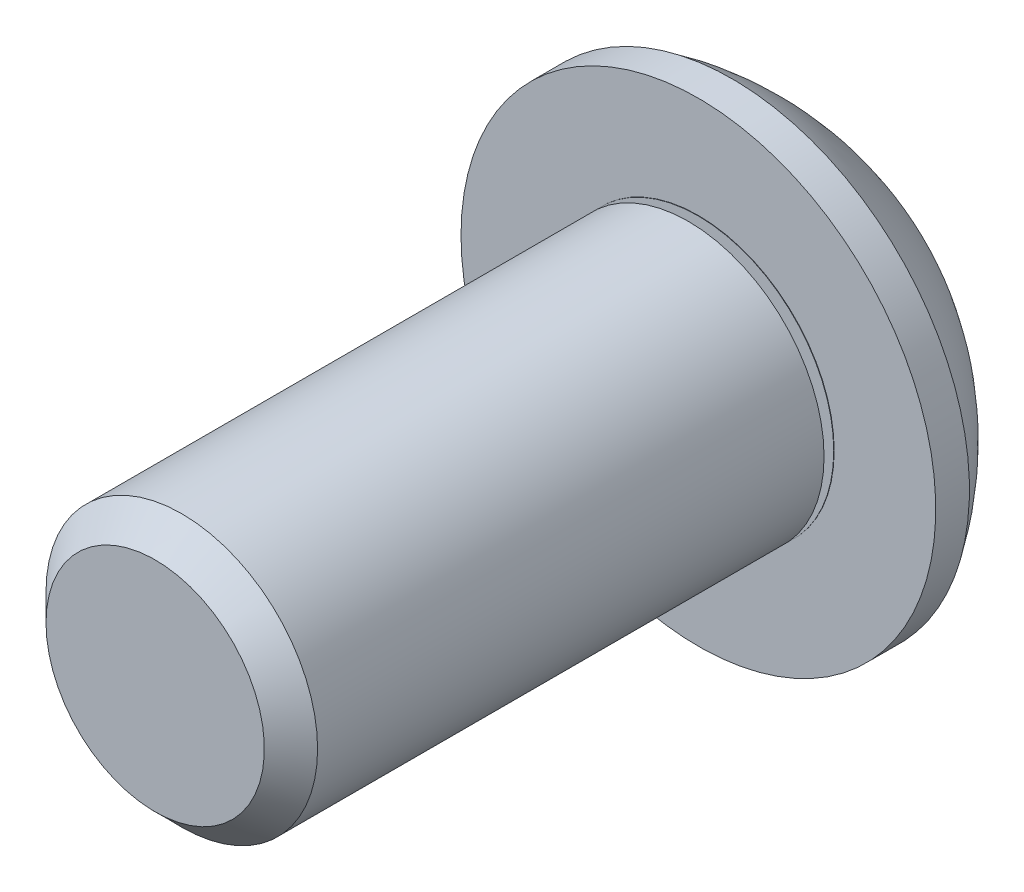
ISO-10303-21;
HEADER;
FILE_DESCRIPTION(('STEP AP214'),'2;1');
FILE_NAME('part.step','',(''),(''),'','','');
FILE_SCHEMA(('AUTOMOTIVE_DESIGN { 1 0 10303 214 1 1 1 1 }'));
ENDSEC;
DATA;
#1=APPLICATION_CONTEXT('core data for automotive mechanical design processes');
#2=APPLICATION_PROTOCOL_DEFINITION('international standard','automotive_design',2000,#1);
#3=PRODUCT_CONTEXT('',#1,'mechanical');
#4=PRODUCT('Part','Part','',(#3));
#5=PRODUCT_RELATED_PRODUCT_CATEGORY('part','',(#4));
#6=PRODUCT_DEFINITION_FORMATION('','',#4);
#7=PRODUCT_DEFINITION_CONTEXT('part definition',#1,'design');
#8=PRODUCT_DEFINITION('design','',#6,#7);
#9=PRODUCT_DEFINITION_SHAPE('','',#8);
#10=(LENGTH_UNIT() NAMED_UNIT(*) SI_UNIT(.MILLI.,.METRE.));
#11=(NAMED_UNIT(*) PLANE_ANGLE_UNIT() SI_UNIT($,.RADIAN.));
#12=(NAMED_UNIT(*) SI_UNIT($,.STERADIAN.) SOLID_ANGLE_UNIT());
#13=UNCERTAINTY_MEASURE_WITH_UNIT(LENGTH_MEASURE(1.E-05),#10,'distance_accuracy_value','');
#14=(GEOMETRIC_REPRESENTATION_CONTEXT(3) GLOBAL_UNCERTAINTY_ASSIGNED_CONTEXT((#13)) GLOBAL_UNIT_ASSIGNED_CONTEXT((#10,
#11,#12)) REPRESENTATION_CONTEXT('',''));
#15=CARTESIAN_POINT('',(0.,0.,0.));
#16=DIRECTION('',(0.,0.,1.));
#17=DIRECTION('',(1.,0.,0.));
#18=AXIS2_PLACEMENT_3D('',#15,#16,#17);
#19=CARTESIAN_POINT('',(0.,0.,2.96553842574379));
#20=DIRECTION('',(0.,0.,-1.));
#21=DIRECTION('',(-1.,0.,0.));
#22=AXIS2_PLACEMENT_3D('',#19,#20,#21);
#23=DEGENERATE_TOROIDAL_SURFACE('',#22,0.190101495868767,6.858,.F.);
#24=CARTESIAN_POINT('',(0.,0.,-3.3528));
#25=DIRECTION('',(0.,0.,-1.));
#26=DIRECTION('',(-1.,0.,0.));
#27=AXIS2_PLACEMENT_3D('',#24,#25,#26);
#28=CIRCLE('',#27,2.4765);
#29=CARTESIAN_POINT('',(-2.4765,0.,-3.3528));
#30=VERTEX_POINT('',#29);
#31=EDGE_CURVE('E11',#30,#30,#28,.T.);
#32=ORIENTED_EDGE('',*,*,#31,.F.);
#33=EDGE_LOOP('',(#32));
#34=FACE_BOUND('',#33,.T.);
#35=CARTESIAN_POINT('',(0.,0.,-0.787399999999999));
#36=DIRECTION('',(0.,0.,-1.));
#37=DIRECTION('',(-1.,0.,0.));
#38=AXIS2_PLACEMENT_3D('',#35,#36,#37);
#39=CIRCLE('',#38,5.54990000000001);
#40=CARTESIAN_POINT('',(-5.54990000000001,0.,-0.787399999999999));
#41=VERTEX_POINT('',#40);
#42=EDGE_CURVE('E164',#41,#41,#39,.T.);
#43=ORIENTED_EDGE('',*,*,#42,.T.);
#44=EDGE_LOOP('',(#43));
#45=FACE_BOUND('',#44,.T.);
#46=ADVANCED_FACE('F49',(#34,#45),#23,.F.);
#47=CARTESIAN_POINT('',(0.,0.,-3.3528));
#48=DIRECTION('',(0.,0.,1.));
#49=DIRECTION('',(1.,0.,0.));
#50=AXIS2_PLACEMENT_3D('',#47,#48,#49);
#51=PLANE('',#50);
#52=DIRECTION('',(-0.5,-0.866025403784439,0.));
#53=VECTOR('',#52,1.);
#54=CARTESIAN_POINT('',(2.28769270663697,0.,-3.3528));
#55=LINE('',#54,#53);
#56=CARTESIAN_POINT('',(2.28769270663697,0.,-3.3528));
#57=VERTEX_POINT('',#56);
#58=CARTESIAN_POINT('',(1.14384635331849,-1.9812,-3.3528));
#59=VERTEX_POINT('',#58);
#60=EDGE_CURVE('E145',#57,#59,#55,.T.);
#61=ORIENTED_EDGE('',*,*,#60,.F.);
#62=DIRECTION('',(0.5,-0.866025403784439,0.));
#63=VECTOR('',#62,1.);
#64=CARTESIAN_POINT('',(1.14384635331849,1.9812,-3.3528));
#65=LINE('',#64,#63);
#66=CARTESIAN_POINT('',(1.14384635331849,1.9812,-3.3528));
#67=VERTEX_POINT('',#66);
#68=EDGE_CURVE('E64',#67,#57,#65,.T.);
#69=ORIENTED_EDGE('',*,*,#68,.F.);
#70=DIRECTION('',(1.,0.,0.));
#71=VECTOR('',#70,1.);
#72=CARTESIAN_POINT('',(-1.14384635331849,1.9812,-3.3528));
#73=LINE('',#72,#71);
#74=CARTESIAN_POINT('',(-1.14384635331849,1.9812,-3.3528));
#75=VERTEX_POINT('',#74);
#76=EDGE_CURVE('E158',#75,#67,#73,.T.);
#77=ORIENTED_EDGE('',*,*,#76,.F.);
#78=DIRECTION('',(0.5,0.866025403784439,0.));
#79=VECTOR('',#78,1.);
#80=CARTESIAN_POINT('',(-2.28769270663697,0.,-3.3528));
#81=LINE('',#80,#79);
#82=CARTESIAN_POINT('',(-2.28769270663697,0.,-3.3528));
#83=VERTEX_POINT('',#82);
#84=EDGE_CURVE('E155',#83,#75,#81,.T.);
#85=ORIENTED_EDGE('',*,*,#84,.F.);
#86=DIRECTION('',(-0.5,0.866025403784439,0.));
#87=VECTOR('',#86,1.);
#88=CARTESIAN_POINT('',(-1.14384635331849,-1.9812,-3.3528));
#89=LINE('',#88,#87);
#90=CARTESIAN_POINT('',(-1.14384635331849,-1.9812,-3.3528));
#91=VERTEX_POINT('',#90);
#92=EDGE_CURVE('E112',#91,#83,#89,.T.);
#93=ORIENTED_EDGE('',*,*,#92,.F.);
#94=DIRECTION('',(-1.,0.,0.));
#95=VECTOR('',#94,1.);
#96=CARTESIAN_POINT('',(1.14384635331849,-1.9812,-3.3528));
#97=LINE('',#96,#95);
#98=EDGE_CURVE('E149',#59,#91,#97,.T.);
#99=ORIENTED_EDGE('',*,*,#98,.F.);
#100=EDGE_LOOP('',(#61,#69,#77,#85,#93,#99));
#101=FACE_BOUND('',#100,.T.);
#102=ORIENTED_EDGE('',*,*,#31,.T.);
#103=EDGE_LOOP('',(#102));
#104=FACE_BOUND('',#103,.T.);
#105=ADVANCED_FACE('F213',(#101,#104),#51,.F.);
#106=CARTESIAN_POINT('',(-2.55270000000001,0.,12.7));
#107=DIRECTION('',(0.,0.,-1.));
#108=DIRECTION('',(-1.,0.,0.));
#109=AXIS2_PLACEMENT_3D('',#106,#107,#108);
#110=PLANE('',#109);
#111=CARTESIAN_POINT('',(0.,0.,12.7));
#112=DIRECTION('',(0.,0.,-1.));
#113=DIRECTION('',(-1.,0.,0.));
#114=AXIS2_PLACEMENT_3D('',#111,#112,#113);
#115=CIRCLE('',#114,2.55270000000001);
#116=CARTESIAN_POINT('',(-2.55270000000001,0.,12.7));
#117=VERTEX_POINT('',#116);
#118=EDGE_CURVE('E57',#117,#117,#115,.T.);
#119=ORIENTED_EDGE('',*,*,#118,.F.);
#120=EDGE_LOOP('',(#119));
#121=FACE_BOUND('',#120,.T.);
#122=ADVANCED_FACE('F211',(#121),#110,.F.);
#123=CARTESIAN_POINT('',(0.,0.,12.7));
#124=DIRECTION('',(0.,0.,-1.));
#125=DIRECTION('',(-1.,0.,0.));
#126=AXIS2_PLACEMENT_3D('',#123,#124,#125);
#127=CONICAL_SURFACE('',#126,2.55270000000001,0.785398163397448);
#128=CARTESIAN_POINT('',(0.,0.,12.0777));
#129=DIRECTION('',(0.,0.,-1.));
#130=DIRECTION('',(-1.,0.,0.));
#131=AXIS2_PLACEMENT_3D('',#128,#129,#130);
#132=CIRCLE('',#131,3.17500000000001);
#133=CARTESIAN_POINT('',(-3.17500000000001,0.,12.0777));
#134=VERTEX_POINT('',#133);
#135=EDGE_CURVE('E201',#134,#134,#132,.T.);
#136=ORIENTED_EDGE('',*,*,#135,.F.);
#137=EDGE_LOOP('',(#136));
#138=FACE_BOUND('',#137,.T.);
#139=ORIENTED_EDGE('',*,*,#118,.T.);
#140=EDGE_LOOP('',(#139));
#141=FACE_BOUND('',#140,.T.);
#142=ADVANCED_FACE('F209',(#138,#141),#127,.T.);
#143=CARTESIAN_POINT('',(0.,0.,-10.585154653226));
#144=DIRECTION('',(0.,0.,-1.));
#145=DIRECTION('',(-1.,0.,0.));
#146=AXIS2_PLACEMENT_3D('',#143,#144,#145);
#147=CYLINDRICAL_SURFACE('',#146,3.17500000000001);
#148=CARTESIAN_POINT('',(0.,0.,0.236498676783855));
#149=DIRECTION('',(0.,0.,-1.));
#150=DIRECTION('',(-1.,0.,0.));
#151=AXIS2_PLACEMENT_3D('',#148,#149,#150);
#152=CIRCLE('',#151,3.175);
#153=CARTESIAN_POINT('',(-3.175,0.,0.236498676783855));
#154=VERTEX_POINT('',#153);
#155=EDGE_CURVE('E197',#154,#154,#152,.T.);
#156=ORIENTED_EDGE('',*,*,#155,.F.);
#157=EDGE_LOOP('',(#156));
#158=FACE_BOUND('',#157,.T.);
#159=ORIENTED_EDGE('',*,*,#135,.T.);
#160=EDGE_LOOP('',(#159));
#161=FACE_BOUND('',#160,.T.);
#162=ADVANCED_FACE('F219',(#158,#161),#147,.T.);
#163=CARTESIAN_POINT('',(0.,0.,0.236498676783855));
#164=DIRECTION('',(0.,0.,1.));
#165=DIRECTION('',(1.,0.,0.));
#166=AXIS2_PLACEMENT_3D('',#163,#164,#165);
#167=CONICAL_SURFACE('',#166,3.175,1.22173047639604);
#168=CARTESIAN_POINT('',(0.,0.,0.0487938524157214));
#169=DIRECTION('',(0.,0.,-1.));
#170=DIRECTION('',(-1.,0.,0.));
#171=AXIS2_PLACEMENT_3D('',#168,#169,#170);
#172=CIRCLE('',#171,2.65928523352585);
#173=CARTESIAN_POINT('',(-2.65928523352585,0.,0.0487938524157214));
#174=VERTEX_POINT('',#173);
#175=EDGE_CURVE('E193',#174,#174,#172,.T.);
#176=ORIENTED_EDGE('',*,*,#175,.F.);
#177=EDGE_LOOP('',(#176));
#178=FACE_BOUND('',#177,.T.);
#179=ORIENTED_EDGE('',*,*,#155,.T.);
#180=EDGE_LOOP('',(#179));
#181=FACE_BOUND('',#180,.T.);
#182=ADVANCED_FACE('F259',(#178,#181),#167,.T.);
#183=CARTESIAN_POINT('',(0.,0.,0.0300000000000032));
#184=DIRECTION('',(0.,0.,-1.));
#185=DIRECTION('',(-1.,0.,0.));
#186=AXIS2_PLACEMENT_3D('',#183,#184,#185);
#187=TOROIDAL_SURFACE('',#186,2.66612563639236,0.0200000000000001);
#188=CARTESIAN_POINT('',(0.,0.,0.0100000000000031));
#189=DIRECTION('',(0.,0.,-1.));
#190=DIRECTION('',(-1.,0.,0.));
#191=AXIS2_PLACEMENT_3D('',#188,#189,#190);
#192=CIRCLE('',#191,2.66612563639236);
#193=CARTESIAN_POINT('',(-2.66612563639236,0.,0.0100000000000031));
#194=VERTEX_POINT('',#193);
#195=EDGE_CURVE('E189',#194,#194,#192,.T.);
#196=ORIENTED_EDGE('',*,*,#195,.F.);
#197=EDGE_LOOP('',(#196));
#198=FACE_BOUND('',#197,.T.);
#199=ORIENTED_EDGE('',*,*,#175,.T.);
#200=EDGE_LOOP('',(#199));
#201=FACE_BOUND('',#200,.T.);
#202=ADVANCED_FACE('F253',(#198,#201),#187,.F.);
#203=CARTESIAN_POINT('',(-3.175,0.,0.0100000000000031));
#204=DIRECTION('',(0.,0.,-1.));
#205=DIRECTION('',(-1.,0.,0.));
#206=AXIS2_PLACEMENT_3D('',#203,#204,#205);
#207=PLANE('',#206);
#208=CARTESIAN_POINT('',(0.,0.,0.0100000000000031));
#209=DIRECTION('',(0.,0.,-1.));
#210=DIRECTION('',(-1.,0.,0.));
#211=AXIS2_PLACEMENT_3D('',#208,#209,#210);
#212=CIRCLE('',#211,3.175);
#213=CARTESIAN_POINT('',(-3.175,0.,0.0100000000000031));
#214=VERTEX_POINT('',#213);
#215=EDGE_CURVE('E185',#214,#214,#212,.T.);
#216=ORIENTED_EDGE('',*,*,#215,.F.);
#217=EDGE_LOOP('',(#216));
#218=FACE_BOUND('',#217,.T.);
#219=ORIENTED_EDGE('',*,*,#195,.T.);
#220=EDGE_LOOP('',(#219));
#221=FACE_BOUND('',#220,.T.);
#222=ADVANCED_FACE('F247',(#218,#221),#207,.F.);
#223=CARTESIAN_POINT('',(0.,0.,-10.585154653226));
#224=DIRECTION('',(0.,0.,-1.));
#225=DIRECTION('',(-1.,0.,0.));
#226=AXIS2_PLACEMENT_3D('',#223,#224,#225);
#227=CYLINDRICAL_SURFACE('',#226,3.175);
#228=CARTESIAN_POINT('',(0.,0.,0.));
#229=DIRECTION('',(0.,0.,-1.));
#230=DIRECTION('',(-1.,0.,0.));
#231=AXIS2_PLACEMENT_3D('',#228,#229,#230);
#232=CIRCLE('',#231,3.175);
#233=CARTESIAN_POINT('',(-3.175,0.,0.));
#234=VERTEX_POINT('',#233);
#235=EDGE_CURVE('E181',#234,#234,#232,.T.);
#236=ORIENTED_EDGE('',*,*,#235,.F.);
#237=EDGE_LOOP('',(#236));
#238=FACE_BOUND('',#237,.T.);
#239=ORIENTED_EDGE('',*,*,#215,.T.);
#240=EDGE_LOOP('',(#239));
#241=FACE_BOUND('',#240,.T.);
#242=ADVANCED_FACE('F241',(#238,#241),#227,.T.);
#243=CARTESIAN_POINT('',(-5.54990000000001,0.,0.));
#244=DIRECTION('',(0.,0.,-1.));
#245=DIRECTION('',(-1.,0.,0.));
#246=AXIS2_PLACEMENT_3D('',#243,#244,#245);
#247=PLANE('',#246);
#248=CARTESIAN_POINT('',(0.,0.,0.));
#249=DIRECTION('',(0.,0.,-1.));
#250=DIRECTION('',(-1.,0.,0.));
#251=AXIS2_PLACEMENT_3D('',#248,#249,#250);
#252=CIRCLE('',#251,5.54990000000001);
#253=CARTESIAN_POINT('',(-5.54990000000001,0.,0.));
#254=VERTEX_POINT('',#253);
#255=EDGE_CURVE('E177',#254,#254,#252,.T.);
#256=ORIENTED_EDGE('',*,*,#255,.F.);
#257=EDGE_LOOP('',(#256));
#258=FACE_BOUND('',#257,.T.);
#259=ORIENTED_EDGE('',*,*,#235,.T.);
#260=EDGE_LOOP('',(#259));
#261=FACE_BOUND('',#260,.T.);
#262=ADVANCED_FACE('F235',(#258,#261),#247,.F.);
#263=CARTESIAN_POINT('',(0.,0.,-10.585154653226));
#264=DIRECTION('',(0.,0.,-1.));
#265=DIRECTION('',(-1.,0.,0.));
#266=AXIS2_PLACEMENT_3D('',#263,#264,#265);
#267=CYLINDRICAL_SURFACE('',#266,5.54990000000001);
#268=ORIENTED_EDGE('',*,*,#42,.F.);
#269=EDGE_LOOP('',(#268));
#270=FACE_BOUND('',#269,.T.);
#271=ORIENTED_EDGE('',*,*,#255,.T.);
#272=EDGE_LOOP('',(#271));
#273=FACE_BOUND('',#272,.T.);
#274=ADVANCED_FACE('F231',(#270,#273),#267,.T.);
#275=CARTESIAN_POINT('',(1.14384635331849,1.9812,-1.143));
#276=DIRECTION('',(0.866025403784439,0.5,0.));
#277=DIRECTION('',(-0.5,0.866025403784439,0.));
#278=AXIS2_PLACEMENT_3D('',#275,#276,#277);
#279=PLANE('',#278);
#280=ORIENTED_EDGE('',*,*,#68,.T.);
#281=DIRECTION('',(0.,0.,-1.));
#282=VECTOR('',#281,1.);
#283=CARTESIAN_POINT('',(2.28769270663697,0.,-1.143));
#284=LINE('',#283,#282);
#285=CARTESIAN_POINT('',(2.28769270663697,0.,-1.143));
#286=VERTEX_POINT('',#285);
#287=EDGE_CURVE('E94',#286,#57,#284,.T.);
#288=ORIENTED_EDGE('',*,*,#287,.F.);
#289=DIRECTION('',(0.5,-0.866025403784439,0.));
#290=VECTOR('',#289,1.);
#291=CARTESIAN_POINT('',(1.14384635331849,1.9812,-1.143));
#292=LINE('',#291,#290);
#293=CARTESIAN_POINT('',(1.14384635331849,1.9812,-1.143));
#294=VERTEX_POINT('',#293);
#295=EDGE_CURVE('E161',#294,#286,#292,.T.);
#296=ORIENTED_EDGE('',*,*,#295,.F.);
#297=DIRECTION('',(0.,0.,-1.));
#298=VECTOR('',#297,1.);
#299=CARTESIAN_POINT('',(1.14384635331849,1.9812,-1.143));
#300=LINE('',#299,#298);
#301=EDGE_CURVE('E72',#294,#67,#300,.T.);
#302=ORIENTED_EDGE('',*,*,#301,.T.);
#303=EDGE_LOOP('',(#280,#288,#296,#302));
#304=FACE_BOUND('',#303,.T.);
#305=ADVANCED_FACE('F234',(#304),#279,.F.);
#306=CARTESIAN_POINT('',(-1.14384635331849,1.9812,-1.143));
#307=DIRECTION('',(0.,1.,0.));
#308=DIRECTION('',(0.,0.,1.));
#309=AXIS2_PLACEMENT_3D('',#306,#307,#308);
#310=PLANE('',#309);
#311=ORIENTED_EDGE('',*,*,#76,.T.);
#312=ORIENTED_EDGE('',*,*,#301,.F.);
#313=DIRECTION('',(1.,0.,0.));
#314=VECTOR('',#313,1.);
#315=CARTESIAN_POINT('',(-1.14384635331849,1.9812,-1.143));
#316=LINE('',#315,#314);
#317=CARTESIAN_POINT('',(-1.14384635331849,1.9812,-1.143));
#318=VERTEX_POINT('',#317);
#319=EDGE_CURVE('E126',#318,#294,#316,.T.);
#320=ORIENTED_EDGE('',*,*,#319,.F.);
#321=DIRECTION('',(0.,0.,-1.));
#322=VECTOR('',#321,1.);
#323=CARTESIAN_POINT('',(-1.14384635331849,1.9812,-1.143));
#324=LINE('',#323,#322);
#325=EDGE_CURVE('E117',#318,#75,#324,.T.);
#326=ORIENTED_EDGE('',*,*,#325,.T.);
#327=EDGE_LOOP('',(#311,#312,#320,#326));
#328=FACE_BOUND('',#327,.T.);
#329=ADVANCED_FACE('F277',(#328),#310,.F.);
#330=CARTESIAN_POINT('',(-2.28769270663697,0.,-1.143));
#331=DIRECTION('',(-0.866025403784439,0.5,0.));
#332=DIRECTION('',(-0.5,-0.866025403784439,0.));
#333=AXIS2_PLACEMENT_3D('',#330,#331,#332);
#334=PLANE('',#333);
#335=ORIENTED_EDGE('',*,*,#84,.T.);
#336=ORIENTED_EDGE('',*,*,#325,.F.);
#337=DIRECTION('',(0.5,0.866025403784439,0.));
#338=VECTOR('',#337,1.);
#339=CARTESIAN_POINT('',(-2.28769270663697,0.,-1.143));
#340=LINE('',#339,#338);
#341=CARTESIAN_POINT('',(-2.28769270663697,0.,-1.143));
#342=VERTEX_POINT('',#341);
#343=EDGE_CURVE('E121',#342,#318,#340,.T.);
#344=ORIENTED_EDGE('',*,*,#343,.F.);
#345=DIRECTION('',(0.,0.,-1.));
#346=VECTOR('',#345,1.);
#347=CARTESIAN_POINT('',(-2.28769270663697,0.,-1.143));
#348=LINE('',#347,#346);
#349=EDGE_CURVE('E105',#342,#83,#348,.T.);
#350=ORIENTED_EDGE('',*,*,#349,.T.);
#351=EDGE_LOOP('',(#335,#336,#344,#350));
#352=FACE_BOUND('',#351,.T.);
#353=ADVANCED_FACE('F122',(#352),#334,.F.);
#354=CARTESIAN_POINT('',(-1.14384635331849,-1.9812,-1.143));
#355=DIRECTION('',(-0.866025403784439,-0.5,0.));
#356=DIRECTION('',(0.5,-0.866025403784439,0.));
#357=AXIS2_PLACEMENT_3D('',#354,#355,#356);
#358=PLANE('',#357);
#359=ORIENTED_EDGE('',*,*,#92,.T.);
#360=ORIENTED_EDGE('',*,*,#349,.F.);
#361=DIRECTION('',(-0.5,0.866025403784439,0.));
#362=VECTOR('',#361,1.);
#363=CARTESIAN_POINT('',(-1.14384635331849,-1.9812,-1.143));
#364=LINE('',#363,#362);
#365=CARTESIAN_POINT('',(-1.14384635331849,-1.9812,-1.143));
#366=VERTEX_POINT('',#365);
#367=EDGE_CURVE('E109',#366,#342,#364,.T.);
#368=ORIENTED_EDGE('',*,*,#367,.F.);
#369=DIRECTION('',(0.,0.,-1.));
#370=VECTOR('',#369,1.);
#371=CARTESIAN_POINT('',(-1.14384635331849,-1.9812,-1.143));
#372=LINE('',#371,#370);
#373=EDGE_CURVE('E118',#366,#91,#372,.T.);
#374=ORIENTED_EDGE('',*,*,#373,.T.);
#375=EDGE_LOOP('',(#359,#360,#368,#374));
#376=FACE_BOUND('',#375,.T.);
#377=ADVANCED_FACE('F107',(#376),#358,.F.);
#378=CARTESIAN_POINT('',(1.14384635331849,-1.9812,-1.143));
#379=DIRECTION('',(0.,-1.,0.));
#380=DIRECTION('',(0.,0.,-1.));
#381=AXIS2_PLACEMENT_3D('',#378,#379,#380);
#382=PLANE('',#381);
#383=ORIENTED_EDGE('',*,*,#98,.T.);
#384=ORIENTED_EDGE('',*,*,#373,.F.);
#385=DIRECTION('',(-1.,0.,0.));
#386=VECTOR('',#385,1.);
#387=CARTESIAN_POINT('',(1.14384635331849,-1.9812,-1.143));
#388=LINE('',#387,#386);
#389=CARTESIAN_POINT('',(1.14384635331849,-1.9812,-1.143));
#390=VERTEX_POINT('',#389);
#391=EDGE_CURVE('E132',#390,#366,#388,.T.);
#392=ORIENTED_EDGE('',*,*,#391,.F.);
#393=DIRECTION('',(0.,0.,-1.));
#394=VECTOR('',#393,1.);
#395=CARTESIAN_POINT('',(1.14384635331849,-1.9812,-1.143));
#396=LINE('',#395,#394);
#397=EDGE_CURVE('E169',#390,#59,#396,.T.);
#398=ORIENTED_EDGE('',*,*,#397,.T.);
#399=EDGE_LOOP('',(#383,#384,#392,#398));
#400=FACE_BOUND('',#399,.T.);
#401=ADVANCED_FACE('F281',(#400),#382,.F.);
#402=CARTESIAN_POINT('',(2.28769270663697,0.,-1.143));
#403=DIRECTION('',(0.866025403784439,-0.5,0.));
#404=DIRECTION('',(0.5,0.866025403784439,0.));
#405=AXIS2_PLACEMENT_3D('',#402,#403,#404);
#406=PLANE('',#405);
#407=ORIENTED_EDGE('',*,*,#60,.T.);
#408=ORIENTED_EDGE('',*,*,#397,.F.);
#409=DIRECTION('',(-0.5,-0.866025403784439,0.));
#410=VECTOR('',#409,1.);
#411=CARTESIAN_POINT('',(2.28769270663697,0.,-1.143));
#412=LINE('',#411,#410);
#413=EDGE_CURVE('E137',#286,#390,#412,.T.);
#414=ORIENTED_EDGE('',*,*,#413,.F.);
#415=ORIENTED_EDGE('',*,*,#287,.T.);
#416=EDGE_LOOP('',(#407,#408,#414,#415));
#417=FACE_BOUND('',#416,.T.);
#418=ADVANCED_FACE('F278',(#417),#406,.F.);
#419=CARTESIAN_POINT('',(3.43153905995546,-1.9812,-1.143));
#420=DIRECTION('',(0.,0.,-1.));
#421=DIRECTION('',(-1.,0.,0.));
#422=AXIS2_PLACEMENT_3D('',#419,#420,#421);
#423=PLANE('',#422);
#424=ORIENTED_EDGE('',*,*,#295,.T.);
#425=ORIENTED_EDGE('',*,*,#413,.T.);
#426=ORIENTED_EDGE('',*,*,#391,.T.);
#427=ORIENTED_EDGE('',*,*,#367,.T.);
#428=ORIENTED_EDGE('',*,*,#343,.T.);
#429=ORIENTED_EDGE('',*,*,#319,.T.);
#430=EDGE_LOOP('',(#424,#425,#426,#427,#428,#429));
#431=FACE_BOUND('',#430,.T.);
#432=ADVANCED_FACE('F129',(#431),#423,.T.);
#433=CLOSED_SHELL('',(#46,#105,#122,#142,#162,#182,#202,#222,#242,#262,#274,#305,#329,#353,#377,
#401,#418,#432));
#434=MANIFOLD_SOLID_BREP('B2',#433);
#435=ADVANCED_BREP_SHAPE_REPRESENTATION('',(#18,#434),#14);
#436=SHAPE_DEFINITION_REPRESENTATION(#9,#435);
ENDSEC;
END-ISO-10303-21;
